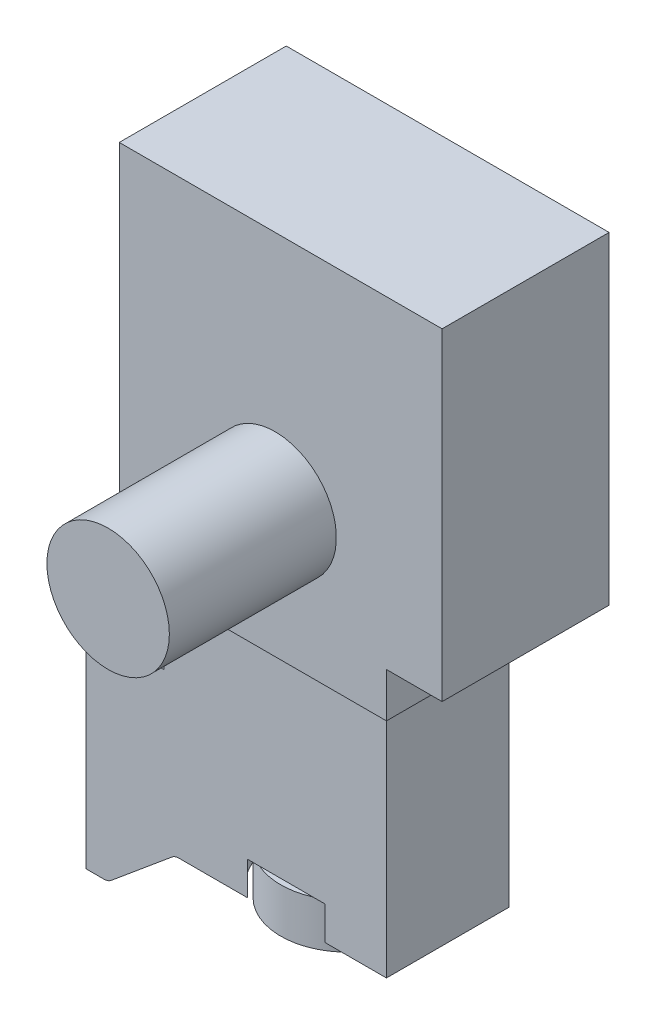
ISO-10303-21;
HEADER;
FILE_DESCRIPTION(('STEP AP214'),'2;1');
FILE_NAME('part.step','',(''),(''),'','','');
FILE_SCHEMA(('AUTOMOTIVE_DESIGN { 1 0 10303 214 1 1 1 1 }'));
ENDSEC;
DATA;
#1=APPLICATION_CONTEXT('core data for automotive mechanical design processes');
#2=APPLICATION_PROTOCOL_DEFINITION('international standard','automotive_design',2000,#1);
#3=PRODUCT_CONTEXT('',#1,'mechanical');
#4=PRODUCT('Part','Part','',(#3));
#5=PRODUCT_RELATED_PRODUCT_CATEGORY('part','',(#4));
#6=PRODUCT_DEFINITION_FORMATION('','',#4);
#7=PRODUCT_DEFINITION_CONTEXT('part definition',#1,'design');
#8=PRODUCT_DEFINITION('design','',#6,#7);
#9=PRODUCT_DEFINITION_SHAPE('','',#8);
#10=(LENGTH_UNIT() NAMED_UNIT(*) SI_UNIT(.MILLI.,.METRE.));
#11=(NAMED_UNIT(*) PLANE_ANGLE_UNIT() SI_UNIT($,.RADIAN.));
#12=(NAMED_UNIT(*) SI_UNIT($,.STERADIAN.) SOLID_ANGLE_UNIT());
#13=UNCERTAINTY_MEASURE_WITH_UNIT(LENGTH_MEASURE(1.E-05),#10,'distance_accuracy_value','');
#14=(GEOMETRIC_REPRESENTATION_CONTEXT(3) GLOBAL_UNCERTAINTY_ASSIGNED_CONTEXT((#13)) GLOBAL_UNIT_ASSIGNED_CONTEXT((#10,
#11,#12)) REPRESENTATION_CONTEXT('',''));
#15=CARTESIAN_POINT('',(0.,0.,0.));
#16=DIRECTION('',(0.,0.,1.));
#17=DIRECTION('',(1.,0.,0.));
#18=AXIS2_PLACEMENT_3D('',#15,#16,#17);
#19=CARTESIAN_POINT('',(18.,8.,0.));
#20=DIRECTION('',(0.,-1.,0.));
#21=DIRECTION('',(1.,0.,0.));
#22=AXIS2_PLACEMENT_3D('',#19,#20,#21);
#23=PLANE('',#22);
#24=DIRECTION('',(1.,0.,0.));
#25=VECTOR('',#24,1.);
#26=CARTESIAN_POINT('',(8.36204993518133,8.,-5.5));
#27=LINE('',#26,#25);
#28=CARTESIAN_POINT('',(14.5358983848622,8.,-5.5));
#29=VERTEX_POINT('',#28);
#30=CARTESIAN_POINT('',(15.6020842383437,8.,-5.5));
#31=VERTEX_POINT('',#30);
#32=EDGE_CURVE('E259',#29,#31,#27,.T.);
#33=ORIENTED_EDGE('',*,*,#32,.T.);
#34=CARTESIAN_POINT('',(18.,8.,0.));
#35=DIRECTION('',(0.,-1.,0.));
#36=DIRECTION('',(1.,0.,0.));
#37=AXIS2_PLACEMENT_3D('',#34,#35,#36);
#38=CIRCLE('',#37,6.);
#39=CARTESIAN_POINT('',(15.6020842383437,8.,5.5));
#40=VERTEX_POINT('',#39);
#41=EDGE_CURVE('E11',#31,#40,#38,.F.);
#42=ORIENTED_EDGE('',*,*,#41,.T.);
#43=DIRECTION('',(1.,0.,0.));
#44=VECTOR('',#43,1.);
#45=CARTESIAN_POINT('',(8.36204993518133,8.,5.5));
#46=LINE('',#45,#44);
#47=CARTESIAN_POINT('',(14.5358983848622,8.,5.5));
#48=VERTEX_POINT('',#47);
#49=EDGE_CURVE('E202',#48,#40,#46,.T.);
#50=ORIENTED_EDGE('',*,*,#49,.F.);
#51=CARTESIAN_POINT('',(18.,8.,0.));
#52=DIRECTION('',(0.,-1.,0.));
#53=DIRECTION('',(1.,0.,0.));
#54=AXIS2_PLACEMENT_3D('',#51,#52,#53);
#55=CIRCLE('',#54,6.50000000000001);
#56=EDGE_CURVE('E54',#48,#29,#55,.T.);
#57=ORIENTED_EDGE('',*,*,#56,.T.);
#58=EDGE_LOOP('',(#33,#42,#50,#57));
#59=FACE_BOUND('',#58,.T.);
#60=ADVANCED_FACE('F31',(#59),#23,.T.);
#61=CARTESIAN_POINT('',(20.3979157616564,8.,5.5));
#62=VERTEX_POINT('',#61);
#63=CARTESIAN_POINT('',(21.4641016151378,8.,5.5));
#64=VERTEX_POINT('',#63);
#65=EDGE_CURVE('E194',#62,#64,#46,.T.);
#66=ORIENTED_EDGE('',*,*,#65,.F.);
#67=CARTESIAN_POINT('',(20.3979157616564,8.,-5.5));
#68=VERTEX_POINT('',#67);
#69=EDGE_CURVE('E35',#62,#68,#38,.F.);
#70=ORIENTED_EDGE('',*,*,#69,.T.);
#71=CARTESIAN_POINT('',(21.4641016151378,8.,-5.5));
#72=VERTEX_POINT('',#71);
#73=EDGE_CURVE('E257',#68,#72,#27,.T.);
#74=ORIENTED_EDGE('',*,*,#73,.T.);
#75=EDGE_CURVE('E197',#72,#64,#55,.T.);
#76=ORIENTED_EDGE('',*,*,#75,.T.);
#77=EDGE_LOOP('',(#66,#70,#74,#76));
#78=FACE_BOUND('',#77,.T.);
#79=ADVANCED_FACE('F195',(#78),#23,.T.);
#80=CARTESIAN_POINT('',(8.36204993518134,5.,5.5));
#81=DIRECTION('',(0.,1.,0.));
#82=DIRECTION('',(-1.,0.,0.));
#83=AXIS2_PLACEMENT_3D('',#80,#81,#82);
#84=PLANE('',#83);
#85=DIRECTION('',(1.,0.,0.));
#86=VECTOR('',#85,1.);
#87=CARTESIAN_POINT('',(8.36204993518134,5.,5.5));
#88=LINE('',#87,#86);
#89=CARTESIAN_POINT('',(21.4641016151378,5.,5.5));
#90=VERTEX_POINT('',#89);
#91=CARTESIAN_POINT('',(27.,5.,5.5));
#92=VERTEX_POINT('',#91);
#93=EDGE_CURVE('E368',#90,#92,#88,.T.);
#94=ORIENTED_EDGE('',*,*,#93,.F.);
#95=CARTESIAN_POINT('',(18.,5.,0.));
#96=DIRECTION('',(0.,-1.,0.));
#97=DIRECTION('',(1.,0.,0.));
#98=AXIS2_PLACEMENT_3D('',#95,#96,#97);
#99=CIRCLE('',#98,6.50000000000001);
#100=CARTESIAN_POINT('',(21.4641016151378,5.,-5.5));
#101=VERTEX_POINT('',#100);
#102=EDGE_CURVE('E717',#101,#90,#99,.T.);
#103=ORIENTED_EDGE('',*,*,#102,.F.);
#104=DIRECTION('',(1.,0.,0.));
#105=VECTOR('',#104,1.);
#106=CARTESIAN_POINT('',(8.36204993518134,5.,-5.5));
#107=LINE('',#106,#105);
#108=CARTESIAN_POINT('',(27.,5.,-5.5));
#109=VERTEX_POINT('',#108);
#110=EDGE_CURVE('E284',#101,#109,#107,.T.);
#111=ORIENTED_EDGE('',*,*,#110,.T.);
#112=DIRECTION('',(0.,0.,-1.));
#113=VECTOR('',#112,1.);
#114=CARTESIAN_POINT('',(27.,5.,5.5));
#115=LINE('',#114,#113);
#116=EDGE_CURVE('E313',#92,#109,#115,.T.);
#117=ORIENTED_EDGE('',*,*,#116,.F.);
#118=EDGE_LOOP('',(#94,#103,#111,#117));
#119=FACE_BOUND('',#118,.T.);
#120=ADVANCED_FACE('F378',(#119),#84,.F.);
#121=CARTESIAN_POINT('',(5.,31.,7.5));
#122=DIRECTION('',(0.,0.,-1.));
#123=DIRECTION('',(-1.,0.,0.));
#124=AXIS2_PLACEMENT_3D('',#121,#122,#123);
#125=PLANE('',#124);
#126=DIRECTION('',(1.,0.,0.));
#127=VECTOR('',#126,1.);
#128=CARTESIAN_POINT('',(5.,27.,7.5));
#129=LINE('',#128,#127);
#130=CARTESIAN_POINT('',(5.,27.,7.5));
#131=VERTEX_POINT('',#130);
#132=CARTESIAN_POINT('',(29.,27.,7.5));
#133=VERTEX_POINT('',#132);
#134=EDGE_CURVE('E226',#131,#133,#129,.T.);
#135=ORIENTED_EDGE('',*,*,#134,.T.);
#136=DIRECTION('',(0.,-1.,0.));
#137=VECTOR('',#136,1.);
#138=CARTESIAN_POINT('',(29.,31.,7.5));
#139=LINE('',#138,#137);
#140=CARTESIAN_POINT('',(29.,31.,7.5));
#141=VERTEX_POINT('',#140);
#142=EDGE_CURVE('E247',#141,#133,#139,.T.);
#143=ORIENTED_EDGE('',*,*,#142,.F.);
#144=DIRECTION('',(1.,0.,0.));
#145=VECTOR('',#144,1.);
#146=CARTESIAN_POINT('',(5.,31.,7.5));
#147=LINE('',#146,#145);
#148=CARTESIAN_POINT('',(34.,31.,7.5));
#149=VERTEX_POINT('',#148);
#150=EDGE_CURVE('E216',#141,#149,#147,.T.);
#151=ORIENTED_EDGE('',*,*,#150,.T.);
#152=DIRECTION('',(0.,-1.,0.));
#153=VECTOR('',#152,1.);
#154=CARTESIAN_POINT('',(34.,60.,7.5));
#155=LINE('',#154,#153);
#156=CARTESIAN_POINT('',(34.,60.,7.5));
#157=VERTEX_POINT('',#156);
#158=EDGE_CURVE('E230',#157,#149,#155,.T.);
#159=ORIENTED_EDGE('',*,*,#158,.F.);
#160=DIRECTION('',(1.,0.,0.));
#161=VECTOR('',#160,1.);
#162=CARTESIAN_POINT('',(4.99999999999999,60.,7.5));
#163=LINE('',#162,#161);
#164=CARTESIAN_POINT('',(4.99999999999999,60.,7.5));
#165=VERTEX_POINT('',#164);
#166=EDGE_CURVE('E413',#165,#157,#163,.T.);
#167=ORIENTED_EDGE('',*,*,#166,.F.);
#168=DIRECTION('',(0.,-1.,0.));
#169=VECTOR('',#168,1.);
#170=CARTESIAN_POINT('',(5.,31.,7.5));
#171=LINE('',#170,#169);
#172=EDGE_CURVE('E239',#165,#131,#171,.T.);
#173=ORIENTED_EDGE('',*,*,#172,.T.);
#174=EDGE_LOOP('',(#135,#143,#151,#159,#167,#173));
#175=FACE_BOUND('',#174,.T.);
#176=CARTESIAN_POINT('',(19.,39.,7.5));
#177=DIRECTION('',(0.,0.,-1.));
#178=DIRECTION('',(-1.,0.,0.));
#179=AXIS2_PLACEMENT_3D('',#176,#177,#178);
#180=CIRCLE('',#179,5.5);
#181=CARTESIAN_POINT('',(13.5,39.,7.5));
#182=VERTEX_POINT('',#181);
#183=EDGE_CURVE('E254',#182,#182,#180,.F.);
#184=ORIENTED_EDGE('',*,*,#183,.F.);
#185=EDGE_LOOP('',(#184));
#186=FACE_BOUND('',#185,.T.);
#187=ADVANCED_FACE('F409',(#175,#186),#125,.F.);
#188=CARTESIAN_POINT('',(0.,19.,5.5));
#189=DIRECTION('',(0.,-1.,0.));
#190=DIRECTION('',(1.,0.,0.));
#191=AXIS2_PLACEMENT_3D('',#188,#189,#190);
#192=PLANE('',#191);
#193=DIRECTION('',(0.,0.,1.));
#194=VECTOR('',#193,1.);
#195=CARTESIAN_POINT('',(7.,19.,-5.5));
#196=LINE('',#195,#194);
#197=CARTESIAN_POINT('',(7.,19.,-5.5));
#198=VERTEX_POINT('',#197);
#199=CARTESIAN_POINT('',(7.,19.,5.5));
#200=VERTEX_POINT('',#199);
#201=EDGE_CURVE('E250',#198,#200,#196,.T.);
#202=ORIENTED_EDGE('',*,*,#201,.F.);
#203=DIRECTION('',(-1.,0.,0.));
#204=VECTOR('',#203,1.);
#205=CARTESIAN_POINT('',(0.,19.,-5.5));
#206=LINE('',#205,#204);
#207=CARTESIAN_POINT('',(0.,19.,-5.5));
#208=VERTEX_POINT('',#207);
#209=EDGE_CURVE('E286',#198,#208,#206,.T.);
#210=ORIENTED_EDGE('',*,*,#209,.T.);
#211=DIRECTION('',(0.,0.,-1.));
#212=VECTOR('',#211,1.);
#213=CARTESIAN_POINT('',(0.,19.,5.5));
#214=LINE('',#213,#212);
#215=CARTESIAN_POINT('',(0.,19.,5.5));
#216=VERTEX_POINT('',#215);
#217=EDGE_CURVE('E303',#216,#208,#214,.T.);
#218=ORIENTED_EDGE('',*,*,#217,.F.);
#219=DIRECTION('',(-1.,0.,0.));
#220=VECTOR('',#219,1.);
#221=CARTESIAN_POINT('',(0.,19.,5.5));
#222=LINE('',#221,#220);
#223=EDGE_CURVE('E300',#200,#216,#222,.T.);
#224=ORIENTED_EDGE('',*,*,#223,.F.);
#225=EDGE_LOOP('',(#202,#210,#218,#224));
#226=FACE_BOUND('',#225,.T.);
#227=ADVANCED_FACE('F498',(#226),#192,.F.);
#228=CARTESIAN_POINT('',(0.,0.,5.5));
#229=DIRECTION('',(1.,0.,0.));
#230=DIRECTION('',(0.,0.,-1.));
#231=AXIS2_PLACEMENT_3D('',#228,#229,#230);
#232=PLANE('',#231);
#233=DIRECTION('',(0.,-1.,0.));
#234=VECTOR('',#233,1.);
#235=CARTESIAN_POINT('',(0.,0.,-5.5));
#236=LINE('',#235,#234);
#237=CARTESIAN_POINT('',(0.,0.,-5.5));
#238=VERTEX_POINT('',#237);
#239=EDGE_CURVE('E339',#208,#238,#236,.T.);
#240=ORIENTED_EDGE('',*,*,#239,.T.);
#241=DIRECTION('',(0.,0.,-1.));
#242=VECTOR('',#241,1.);
#243=CARTESIAN_POINT('',(0.,0.,5.5));
#244=LINE('',#243,#242);
#245=CARTESIAN_POINT('',(0.,0.,5.5));
#246=VERTEX_POINT('',#245);
#247=EDGE_CURVE('E258',#246,#238,#244,.T.);
#248=ORIENTED_EDGE('',*,*,#247,.F.);
#249=DIRECTION('',(0.,-1.,0.));
#250=VECTOR('',#249,1.);
#251=CARTESIAN_POINT('',(0.,0.,5.5));
#252=LINE('',#251,#250);
#253=EDGE_CURVE('E294',#216,#246,#252,.T.);
#254=ORIENTED_EDGE('',*,*,#253,.F.);
#255=ORIENTED_EDGE('',*,*,#217,.T.);
#256=EDGE_LOOP('',(#240,#248,#254,#255));
#257=FACE_BOUND('',#256,.T.);
#258=ADVANCED_FACE('F33',(#257),#232,.F.);
#259=CARTESIAN_POINT('',(0.,0.,5.5));
#260=DIRECTION('',(0.,1.,0.));
#261=DIRECTION('',(0.,0.,1.));
#262=AXIS2_PLACEMENT_3D('',#259,#260,#261);
#263=PLANE('',#262);
#264=DIRECTION('',(1.,0.,0.));
#265=VECTOR('',#264,1.);
#266=CARTESIAN_POINT('',(0.,0.,-5.5));
#267=LINE('',#266,#265);
#268=CARTESIAN_POINT('',(1.63795006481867,0.,-5.5));
#269=VERTEX_POINT('',#268);
#270=EDGE_CURVE('E333',#238,#269,#267,.T.);
#271=ORIENTED_EDGE('',*,*,#270,.T.);
#272=DIRECTION('',(0.,0.,-1.));
#273=VECTOR('',#272,1.);
#274=CARTESIAN_POINT('',(1.63795006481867,0.,5.5));
#275=LINE('',#274,#273);
#276=CARTESIAN_POINT('',(1.63795006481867,0.,5.5));
#277=VERTEX_POINT('',#276);
#278=EDGE_CURVE('E322',#277,#269,#275,.T.);
#279=ORIENTED_EDGE('',*,*,#278,.F.);
#280=DIRECTION('',(1.,0.,0.));
#281=VECTOR('',#280,1.);
#282=CARTESIAN_POINT('',(0.,0.,5.5));
#283=LINE('',#282,#281);
#284=EDGE_CURVE('E334',#246,#277,#283,.T.);
#285=ORIENTED_EDGE('',*,*,#284,.F.);
#286=ORIENTED_EDGE('',*,*,#247,.T.);
#287=EDGE_LOOP('',(#271,#279,#285,#286));
#288=FACE_BOUND('',#287,.T.);
#289=ADVANCED_FACE('F332',(#288),#263,.F.);
#290=CARTESIAN_POINT('',(1.63795006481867,1.,5.5));
#291=DIRECTION('',(0.,0.,-1.));
#292=DIRECTION('',(-1.,0.,0.));
#293=AXIS2_PLACEMENT_3D('',#290,#291,#292);
#294=CYLINDRICAL_SURFACE('',#293,1.);
#295=CARTESIAN_POINT('',(1.63795006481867,1.,-5.5));
#296=DIRECTION('',(0.,0.,1.));
#297=DIRECTION('',(1.,0.,0.));
#298=AXIS2_PLACEMENT_3D('',#295,#296,#297);
#299=CIRCLE('',#298,1.);
#300=CARTESIAN_POINT('',(2.27813446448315,0.231778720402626,-5.5));
#301=VERTEX_POINT('',#300);
#302=EDGE_CURVE('E344',#269,#301,#299,.T.);
#303=ORIENTED_EDGE('',*,*,#302,.T.);
#304=DIRECTION('',(0.,0.,-1.));
#305=VECTOR('',#304,1.);
#306=CARTESIAN_POINT('',(2.27813446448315,0.231778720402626,5.5));
#307=LINE('',#306,#305);
#308=CARTESIAN_POINT('',(2.27813446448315,0.231778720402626,5.5));
#309=VERTEX_POINT('',#308);
#310=EDGE_CURVE('E320',#309,#301,#307,.T.);
#311=ORIENTED_EDGE('',*,*,#310,.F.);
#312=CARTESIAN_POINT('',(1.63795006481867,1.,5.5));
#313=DIRECTION('',(0.,0.,1.));
#314=DIRECTION('',(1.,0.,0.));
#315=AXIS2_PLACEMENT_3D('',#312,#313,#314);
#316=CIRCLE('',#315,1.);
#317=EDGE_CURVE('E366',#277,#309,#316,.T.);
#318=ORIENTED_EDGE('',*,*,#317,.F.);
#319=ORIENTED_EDGE('',*,*,#278,.T.);
#320=EDGE_LOOP('',(#303,#311,#318,#319));
#321=FACE_BOUND('',#320,.T.);
#322=ADVANCED_FACE('F361',(#321),#294,.T.);
#323=CARTESIAN_POINT('',(2.27813446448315,0.231778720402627,5.5));
#324=DIRECTION('',(-0.64018439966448,0.768221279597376,0.));
#325=DIRECTION('',(-0.768221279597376,-0.64018439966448,0.));
#326=AXIS2_PLACEMENT_3D('',#323,#324,#325);
#327=PLANE('',#326);
#328=DIRECTION('',(0.768221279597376,0.64018439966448,0.));
#329=VECTOR('',#328,1.);
#330=CARTESIAN_POINT('',(2.27813446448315,0.231778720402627,-5.5));
#331=LINE('',#330,#329);
#332=CARTESIAN_POINT('',(7.72186553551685,4.76822127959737,-5.5));
#333=VERTEX_POINT('',#332);
#334=EDGE_CURVE('E353',#301,#333,#331,.T.);
#335=ORIENTED_EDGE('',*,*,#334,.T.);
#336=DIRECTION('',(0.,0.,-1.));
#337=VECTOR('',#336,1.);
#338=CARTESIAN_POINT('',(7.72186553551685,4.76822127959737,5.5));
#339=LINE('',#338,#337);
#340=CARTESIAN_POINT('',(7.72186553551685,4.76822127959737,5.5));
#341=VERTEX_POINT('',#340);
#342=EDGE_CURVE('E317',#341,#333,#339,.T.);
#343=ORIENTED_EDGE('',*,*,#342,.F.);
#344=DIRECTION('',(0.768221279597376,0.64018439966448,0.));
#345=VECTOR('',#344,1.);
#346=CARTESIAN_POINT('',(2.27813446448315,0.231778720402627,5.5));
#347=LINE('',#346,#345);
#348=EDGE_CURVE('E364',#309,#341,#347,.T.);
#349=ORIENTED_EDGE('',*,*,#348,.F.);
#350=ORIENTED_EDGE('',*,*,#310,.T.);
#351=EDGE_LOOP('',(#335,#343,#349,#350));
#352=FACE_BOUND('',#351,.T.);
#353=ADVANCED_FACE('F363',(#352),#327,.F.);
#354=CARTESIAN_POINT('',(8.36204993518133,4.,5.5));
#355=DIRECTION('',(0.,0.,-1.));
#356=DIRECTION('',(-1.,0.,0.));
#357=AXIS2_PLACEMENT_3D('',#354,#355,#356);
#358=CYLINDRICAL_SURFACE('',#357,1.);
#359=CARTESIAN_POINT('',(8.36204993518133,4.,-5.5));
#360=DIRECTION('',(0.,0.,-1.));
#361=DIRECTION('',(1.,0.,0.));
#362=AXIS2_PLACEMENT_3D('',#359,#360,#361);
#363=CIRCLE('',#362,1.);
#364=CARTESIAN_POINT('',(8.36204993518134,5.,-5.5));
#365=VERTEX_POINT('',#364);
#366=EDGE_CURVE('E288',#333,#365,#363,.T.);
#367=ORIENTED_EDGE('',*,*,#366,.T.);
#368=DIRECTION('',(0.,0.,-1.));
#369=VECTOR('',#368,1.);
#370=CARTESIAN_POINT('',(8.36204993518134,5.,5.5));
#371=LINE('',#370,#369);
#372=CARTESIAN_POINT('',(8.36204993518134,5.,5.5));
#373=VERTEX_POINT('',#372);
#374=EDGE_CURVE('E282',#373,#365,#371,.T.);
#375=ORIENTED_EDGE('',*,*,#374,.F.);
#376=CARTESIAN_POINT('',(8.36204993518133,4.,5.5));
#377=DIRECTION('',(0.,0.,-1.));
#378=DIRECTION('',(1.,0.,0.));
#379=AXIS2_PLACEMENT_3D('',#376,#377,#378);
#380=CIRCLE('',#379,1.);
#381=EDGE_CURVE('E365',#341,#373,#380,.T.);
#382=ORIENTED_EDGE('',*,*,#381,.F.);
#383=ORIENTED_EDGE('',*,*,#342,.T.);
#384=EDGE_LOOP('',(#367,#375,#382,#383));
#385=FACE_BOUND('',#384,.T.);
#386=ADVANCED_FACE('F358',(#385),#358,.F.);
#387=CARTESIAN_POINT('',(14.5358983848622,5.,-5.5));
#388=VERTEX_POINT('',#387);
#389=EDGE_CURVE('E271',#365,#388,#107,.T.);
#390=ORIENTED_EDGE('',*,*,#389,.T.);
#391=CARTESIAN_POINT('',(14.5358983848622,5.,5.5));
#392=VERTEX_POINT('',#391);
#393=EDGE_CURVE('E279',#392,#388,#99,.T.);
#394=ORIENTED_EDGE('',*,*,#393,.F.);
#395=EDGE_CURVE('E371',#373,#392,#88,.T.);
#396=ORIENTED_EDGE('',*,*,#395,.F.);
#397=ORIENTED_EDGE('',*,*,#374,.T.);
#398=EDGE_LOOP('',(#390,#394,#396,#397));
#399=FACE_BOUND('',#398,.T.);
#400=ADVANCED_FACE('F277',(#399),#84,.F.);
#401=CARTESIAN_POINT('',(27.,5.,5.5));
#402=DIRECTION('',(-1.,0.,0.));
#403=DIRECTION('',(0.,-1.,0.));
#404=AXIS2_PLACEMENT_3D('',#401,#402,#403);
#405=PLANE('',#404);
#406=DIRECTION('',(0.,1.,0.));
#407=VECTOR('',#406,1.);
#408=CARTESIAN_POINT('',(27.,5.,-5.5));
#409=LINE('',#408,#407);
#410=CARTESIAN_POINT('',(27.,27.,-5.5));
#411=VERTEX_POINT('',#410);
#412=EDGE_CURVE('E283',#109,#411,#409,.T.);
#413=ORIENTED_EDGE('',*,*,#412,.T.);
#414=DIRECTION('',(0.,0.,-1.));
#415=VECTOR('',#414,1.);
#416=CARTESIAN_POINT('',(27.,27.,5.5));
#417=LINE('',#416,#415);
#418=CARTESIAN_POINT('',(27.,27.,5.5));
#419=VERTEX_POINT('',#418);
#420=EDGE_CURVE('E384',#419,#411,#417,.T.);
#421=ORIENTED_EDGE('',*,*,#420,.F.);
#422=DIRECTION('',(0.,1.,0.));
#423=VECTOR('',#422,1.);
#424=CARTESIAN_POINT('',(27.,5.,5.5));
#425=LINE('',#424,#423);
#426=EDGE_CURVE('E304',#92,#419,#425,.T.);
#427=ORIENTED_EDGE('',*,*,#426,.F.);
#428=ORIENTED_EDGE('',*,*,#116,.T.);
#429=EDGE_LOOP('',(#413,#421,#427,#428));
#430=FACE_BOUND('',#429,.T.);
#431=ADVANCED_FACE('F382',(#430),#405,.F.);
#432=CARTESIAN_POINT('',(8.36204993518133,4.,5.5));
#433=DIRECTION('',(0.,0.,1.));
#434=DIRECTION('',(1.,0.,0.));
#435=AXIS2_PLACEMENT_3D('',#432,#433,#434);
#436=PLANE('',#435);
#437=DIRECTION('',(0.,-1.,0.));
#438=VECTOR('',#437,1.);
#439=CARTESIAN_POINT('',(14.5358983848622,8.,5.5));
#440=LINE('',#439,#438);
#441=EDGE_CURVE('E211',#48,#392,#440,.T.);
#442=ORIENTED_EDGE('',*,*,#441,.F.);
#443=ORIENTED_EDGE('',*,*,#49,.T.);
#444=EDGE_CURVE('E190',#40,#62,#46,.T.);
#445=ORIENTED_EDGE('',*,*,#444,.T.);
#446=ORIENTED_EDGE('',*,*,#65,.T.);
#447=DIRECTION('',(0.,-1.,0.));
#448=VECTOR('',#447,1.);
#449=CARTESIAN_POINT('',(21.4641016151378,8.,5.5));
#450=LINE('',#449,#448);
#451=EDGE_CURVE('E206',#90,#64,#450,.F.);
#452=ORIENTED_EDGE('',*,*,#451,.F.);
#453=ORIENTED_EDGE('',*,*,#93,.T.);
#454=ORIENTED_EDGE('',*,*,#426,.T.);
#455=DIRECTION('',(1.,0.,0.));
#456=VECTOR('',#455,1.);
#457=CARTESIAN_POINT('',(7.,27.,5.5));
#458=LINE('',#457,#456);
#459=CARTESIAN_POINT('',(7.,27.,5.5));
#460=VERTEX_POINT('',#459);
#461=EDGE_CURVE('E350',#460,#419,#458,.T.);
#462=ORIENTED_EDGE('',*,*,#461,.F.);
#463=DIRECTION('',(0.,-1.,0.));
#464=VECTOR('',#463,1.);
#465=CARTESIAN_POINT('',(7.,27.,5.5));
#466=LINE('',#465,#464);
#467=EDGE_CURVE('E347',#460,#200,#466,.T.);
#468=ORIENTED_EDGE('',*,*,#467,.T.);
#469=ORIENTED_EDGE('',*,*,#223,.T.);
#470=ORIENTED_EDGE('',*,*,#253,.T.);
#471=ORIENTED_EDGE('',*,*,#284,.T.);
#472=ORIENTED_EDGE('',*,*,#317,.T.);
#473=ORIENTED_EDGE('',*,*,#348,.T.);
#474=ORIENTED_EDGE('',*,*,#381,.T.);
#475=ORIENTED_EDGE('',*,*,#395,.T.);
#476=EDGE_LOOP('',(#442,#443,#445,#446,#452,#453,#454,#462,#468,#469,#470,#471,#472,#473,#474,#475));
#477=FACE_BOUND('',#476,.T.);
#478=ADVANCED_FACE('F205',(#477),#436,.T.);
#479=CARTESIAN_POINT('',(8.36204993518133,4.,-5.5));
#480=DIRECTION('',(0.,0.,1.));
#481=DIRECTION('',(1.,0.,0.));
#482=AXIS2_PLACEMENT_3D('',#479,#480,#481);
#483=PLANE('',#482);
#484=ORIENTED_EDGE('',*,*,#32,.F.);
#485=DIRECTION('',(0.,-1.,0.));
#486=VECTOR('',#485,1.);
#487=CARTESIAN_POINT('',(14.5358983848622,8.,-5.5));
#488=LINE('',#487,#486);
#489=EDGE_CURVE('E186',#29,#388,#488,.T.);
#490=ORIENTED_EDGE('',*,*,#489,.T.);
#491=ORIENTED_EDGE('',*,*,#389,.F.);
#492=ORIENTED_EDGE('',*,*,#366,.F.);
#493=ORIENTED_EDGE('',*,*,#334,.F.);
#494=ORIENTED_EDGE('',*,*,#302,.F.);
#495=ORIENTED_EDGE('',*,*,#270,.F.);
#496=ORIENTED_EDGE('',*,*,#239,.F.);
#497=ORIENTED_EDGE('',*,*,#209,.F.);
#498=DIRECTION('',(0.,-1.,0.));
#499=VECTOR('',#498,1.);
#500=CARTESIAN_POINT('',(7.,27.,-5.5));
#501=LINE('',#500,#499);
#502=CARTESIAN_POINT('',(7.,27.,-5.5));
#503=VERTEX_POINT('',#502);
#504=EDGE_CURVE('E342',#503,#198,#501,.T.);
#505=ORIENTED_EDGE('',*,*,#504,.F.);
#506=DIRECTION('',(-1.,0.,0.));
#507=VECTOR('',#506,1.);
#508=CARTESIAN_POINT('',(27.,27.,-5.5));
#509=LINE('',#508,#507);
#510=EDGE_CURVE('E389',#411,#503,#509,.T.);
#511=ORIENTED_EDGE('',*,*,#510,.F.);
#512=ORIENTED_EDGE('',*,*,#412,.F.);
#513=ORIENTED_EDGE('',*,*,#110,.F.);
#514=DIRECTION('',(0.,-1.,0.));
#515=VECTOR('',#514,1.);
#516=CARTESIAN_POINT('',(21.4641016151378,8.,-5.5));
#517=LINE('',#516,#515);
#518=EDGE_CURVE('E261',#101,#72,#517,.F.);
#519=ORIENTED_EDGE('',*,*,#518,.T.);
#520=ORIENTED_EDGE('',*,*,#73,.F.);
#521=EDGE_CURVE('E262',#31,#68,#27,.T.);
#522=ORIENTED_EDGE('',*,*,#521,.F.);
#523=EDGE_LOOP('',(#484,#490,#491,#492,#493,#494,#495,#496,#497,#505,#511,#512,#513,#519,#520,#522));
#524=FACE_BOUND('',#523,.T.);
#525=ADVANCED_FACE('F269',(#524),#483,.F.);
#526=CARTESIAN_POINT('',(7.,27.,-5.5));
#527=DIRECTION('',(1.,0.,0.));
#528=DIRECTION('',(0.,1.,0.));
#529=AXIS2_PLACEMENT_3D('',#526,#527,#528);
#530=PLANE('',#529);
#531=ORIENTED_EDGE('',*,*,#201,.T.);
#532=ORIENTED_EDGE('',*,*,#467,.F.);
#533=DIRECTION('',(0.,0.,1.));
#534=VECTOR('',#533,1.);
#535=CARTESIAN_POINT('',(7.,27.,-5.5));
#536=LINE('',#535,#534);
#537=EDGE_CURVE('E394',#503,#460,#536,.T.);
#538=ORIENTED_EDGE('',*,*,#537,.F.);
#539=ORIENTED_EDGE('',*,*,#504,.T.);
#540=EDGE_LOOP('',(#531,#532,#538,#539));
#541=FACE_BOUND('',#540,.T.);
#542=ADVANCED_FACE('F481',(#541),#530,.F.);
#543=CARTESIAN_POINT('',(29.,27.,7.5));
#544=DIRECTION('',(0.,1.,0.));
#545=DIRECTION('',(-1.,0.,0.));
#546=AXIS2_PLACEMENT_3D('',#543,#544,#545);
#547=PLANE('',#546);
#548=ORIENTED_EDGE('',*,*,#134,.F.);
#549=DIRECTION('',(0.,0.,1.));
#550=VECTOR('',#549,1.);
#551=CARTESIAN_POINT('',(5.,27.,-7.5));
#552=LINE('',#551,#550);
#553=CARTESIAN_POINT('',(5.,27.,-7.5));
#554=VERTEX_POINT('',#553);
#555=EDGE_CURVE('E234',#554,#131,#552,.T.);
#556=ORIENTED_EDGE('',*,*,#555,.F.);
#557=DIRECTION('',(-1.,0.,0.));
#558=VECTOR('',#557,1.);
#559=CARTESIAN_POINT('',(29.,27.,-7.5));
#560=LINE('',#559,#558);
#561=CARTESIAN_POINT('',(29.,27.,-7.5));
#562=VERTEX_POINT('',#561);
#563=EDGE_CURVE('E232',#562,#554,#560,.T.);
#564=ORIENTED_EDGE('',*,*,#563,.F.);
#565=DIRECTION('',(0.,0.,-1.));
#566=VECTOR('',#565,1.);
#567=CARTESIAN_POINT('',(29.,27.,7.5));
#568=LINE('',#567,#566);
#569=EDGE_CURVE('E229',#133,#562,#568,.T.);
#570=ORIENTED_EDGE('',*,*,#569,.F.);
#571=EDGE_LOOP('',(#548,#556,#564,#570));
#572=FACE_BOUND('',#571,.T.);
#573=ORIENTED_EDGE('',*,*,#461,.T.);
#574=ORIENTED_EDGE('',*,*,#420,.T.);
#575=ORIENTED_EDGE('',*,*,#510,.T.);
#576=ORIENTED_EDGE('',*,*,#537,.T.);
#577=EDGE_LOOP('',(#573,#574,#575,#576));
#578=FACE_BOUND('',#577,.T.);
#579=ADVANCED_FACE('F392',(#572,#578),#547,.F.);
#580=CARTESIAN_POINT('',(29.,31.,7.5));
#581=DIRECTION('',(-1.,0.,0.));
#582=DIRECTION('',(0.,-1.,0.));
#583=AXIS2_PLACEMENT_3D('',#580,#581,#582);
#584=PLANE('',#583);
#585=ORIENTED_EDGE('',*,*,#569,.T.);
#586=DIRECTION('',(0.,-1.,0.));
#587=VECTOR('',#586,1.);
#588=CARTESIAN_POINT('',(29.,31.,-7.5));
#589=LINE('',#588,#587);
#590=CARTESIAN_POINT('',(29.,31.,-7.5));
#591=VERTEX_POINT('',#590);
#592=EDGE_CURVE('E251',#591,#562,#589,.T.);
#593=ORIENTED_EDGE('',*,*,#592,.F.);
#594=DIRECTION('',(0.,0.,-1.));
#595=VECTOR('',#594,1.);
#596=CARTESIAN_POINT('',(29.,31.,7.5));
#597=LINE('',#596,#595);
#598=EDGE_CURVE('E236',#141,#591,#597,.T.);
#599=ORIENTED_EDGE('',*,*,#598,.F.);
#600=ORIENTED_EDGE('',*,*,#142,.T.);
#601=EDGE_LOOP('',(#585,#593,#599,#600));
#602=FACE_BOUND('',#601,.T.);
#603=ADVANCED_FACE('F418',(#602),#584,.F.);
#604=CARTESIAN_POINT('',(29.,31.,-7.5));
#605=DIRECTION('',(0.,0.,1.));
#606=DIRECTION('',(1.,0.,0.));
#607=AXIS2_PLACEMENT_3D('',#604,#605,#606);
#608=PLANE('',#607);
#609=ORIENTED_EDGE('',*,*,#563,.T.);
#610=DIRECTION('',(0.,-1.,0.));
#611=VECTOR('',#610,1.);
#612=CARTESIAN_POINT('',(5.,31.,-7.5));
#613=LINE('',#612,#611);
#614=CARTESIAN_POINT('',(4.99999999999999,60.,-7.5));
#615=VERTEX_POINT('',#614);
#616=EDGE_CURVE('E399',#615,#554,#613,.T.);
#617=ORIENTED_EDGE('',*,*,#616,.F.);
#618=DIRECTION('',(-1.,0.,0.));
#619=VECTOR('',#618,1.);
#620=CARTESIAN_POINT('',(34.,60.,-7.5));
#621=LINE('',#620,#619);
#622=CARTESIAN_POINT('',(34.,60.,-7.5));
#623=VERTEX_POINT('',#622);
#624=EDGE_CURVE('E439',#623,#615,#621,.T.);
#625=ORIENTED_EDGE('',*,*,#624,.F.);
#626=DIRECTION('',(0.,-1.,0.));
#627=VECTOR('',#626,1.);
#628=CARTESIAN_POINT('',(34.,60.,-7.5));
#629=LINE('',#628,#627);
#630=CARTESIAN_POINT('',(34.,31.,-7.5));
#631=VERTEX_POINT('',#630);
#632=EDGE_CURVE('E441',#623,#631,#629,.T.);
#633=ORIENTED_EDGE('',*,*,#632,.T.);
#634=DIRECTION('',(-1.,0.,0.));
#635=VECTOR('',#634,1.);
#636=CARTESIAN_POINT('',(34.,31.,-7.5));
#637=LINE('',#636,#635);
#638=EDGE_CURVE('E224',#631,#591,#637,.T.);
#639=ORIENTED_EDGE('',*,*,#638,.T.);
#640=ORIENTED_EDGE('',*,*,#592,.T.);
#641=EDGE_LOOP('',(#609,#617,#625,#633,#639,#640));
#642=FACE_BOUND('',#641,.T.);
#643=ADVANCED_FACE('F448',(#642),#608,.F.);
#644=CARTESIAN_POINT('',(5.,31.,-7.5));
#645=DIRECTION('',(1.,0.,0.));
#646=DIRECTION('',(0.,1.,0.));
#647=AXIS2_PLACEMENT_3D('',#644,#645,#646);
#648=PLANE('',#647);
#649=ORIENTED_EDGE('',*,*,#555,.T.);
#650=ORIENTED_EDGE('',*,*,#172,.F.);
#651=DIRECTION('',(0.,0.,1.));
#652=VECTOR('',#651,1.);
#653=CARTESIAN_POINT('',(4.99999999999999,60.,-7.5));
#654=LINE('',#653,#652);
#655=EDGE_CURVE('E429',#615,#165,#654,.T.);
#656=ORIENTED_EDGE('',*,*,#655,.F.);
#657=ORIENTED_EDGE('',*,*,#616,.T.);
#658=EDGE_LOOP('',(#649,#650,#656,#657));
#659=FACE_BOUND('',#658,.T.);
#660=ADVANCED_FACE('F446',(#659),#648,.F.);
#661=CARTESIAN_POINT('',(34.,60.,7.5));
#662=DIRECTION('',(-1.,0.,0.));
#663=DIRECTION('',(0.,-1.,0.));
#664=AXIS2_PLACEMENT_3D('',#661,#662,#663);
#665=PLANE('',#664);
#666=DIRECTION('',(0.,0.,-1.));
#667=VECTOR('',#666,1.);
#668=CARTESIAN_POINT('',(34.,31.,7.5));
#669=LINE('',#668,#667);
#670=EDGE_CURVE('E219',#149,#631,#669,.T.);
#671=ORIENTED_EDGE('',*,*,#670,.T.);
#672=ORIENTED_EDGE('',*,*,#632,.F.);
#673=DIRECTION('',(0.,0.,-1.));
#674=VECTOR('',#673,1.);
#675=CARTESIAN_POINT('',(34.,60.,7.5));
#676=LINE('',#675,#674);
#677=EDGE_CURVE('E434',#157,#623,#676,.T.);
#678=ORIENTED_EDGE('',*,*,#677,.F.);
#679=ORIENTED_EDGE('',*,*,#158,.T.);
#680=EDGE_LOOP('',(#671,#672,#678,#679));
#681=FACE_BOUND('',#680,.T.);
#682=ADVANCED_FACE('F443',(#681),#665,.F.);
#683=CARTESIAN_POINT('',(4.99999999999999,60.,-7.5));
#684=DIRECTION('',(0.,-1.,0.));
#685=DIRECTION('',(1.,0.,0.));
#686=AXIS2_PLACEMENT_3D('',#683,#684,#685);
#687=PLANE('',#686);
#688=ORIENTED_EDGE('',*,*,#655,.T.);
#689=ORIENTED_EDGE('',*,*,#166,.T.);
#690=ORIENTED_EDGE('',*,*,#677,.T.);
#691=ORIENTED_EDGE('',*,*,#624,.T.);
#692=EDGE_LOOP('',(#688,#689,#690,#691));
#693=FACE_BOUND('',#692,.T.);
#694=ADVANCED_FACE('F445',(#693),#687,.F.);
#695=CARTESIAN_POINT('',(5.,31.,-7.5));
#696=DIRECTION('',(0.,-1.,0.));
#697=DIRECTION('',(1.,0.,0.));
#698=AXIS2_PLACEMENT_3D('',#695,#696,#697);
#699=PLANE('',#698);
#700=ORIENTED_EDGE('',*,*,#150,.F.);
#701=ORIENTED_EDGE('',*,*,#598,.T.);
#702=ORIENTED_EDGE('',*,*,#638,.F.);
#703=ORIENTED_EDGE('',*,*,#670,.F.);
#704=EDGE_LOOP('',(#700,#701,#702,#703));
#705=FACE_BOUND('',#704,.T.);
#706=ADVANCED_FACE('F423',(#705),#699,.T.);
#707=CARTESIAN_POINT('',(19.,39.,22.5));
#708=DIRECTION('',(0.,0.,-1.));
#709=DIRECTION('',(-1.,0.,0.));
#710=AXIS2_PLACEMENT_3D('',#707,#708,#709);
#711=CYLINDRICAL_SURFACE('',#710,5.5);
#712=CARTESIAN_POINT('',(19.,39.,22.5));
#713=DIRECTION('',(0.,0.,1.));
#714=DIRECTION('',(1.,0.,0.));
#715=AXIS2_PLACEMENT_3D('',#712,#713,#714);
#716=CIRCLE('',#715,5.5);
#717=CARTESIAN_POINT('',(24.5,39.,22.5));
#718=VERTEX_POINT('',#717);
#719=EDGE_CURVE('E213',#718,#718,#716,.T.);
#720=ORIENTED_EDGE('',*,*,#719,.F.);
#721=EDGE_LOOP('',(#720));
#722=FACE_BOUND('',#721,.T.);
#723=ORIENTED_EDGE('',*,*,#183,.T.);
#724=EDGE_LOOP('',(#723));
#725=FACE_BOUND('',#724,.T.);
#726=ADVANCED_FACE('F472',(#722,#725),#711,.T.);
#727=CARTESIAN_POINT('',(19.,39.,22.5));
#728=DIRECTION('',(0.,0.,1.));
#729=DIRECTION('',(1.,0.,0.));
#730=AXIS2_PLACEMENT_3D('',#727,#728,#729);
#731=PLANE('',#730);
#732=ORIENTED_EDGE('',*,*,#719,.T.);
#733=EDGE_LOOP('',(#732));
#734=FACE_BOUND('',#733,.T.);
#735=ADVANCED_FACE('F469',(#734),#731,.T.);
#736=CARTESIAN_POINT('',(18.,8.,0.));
#737=DIRECTION('',(0.,-1.,0.));
#738=DIRECTION('',(1.,0.,0.));
#739=AXIS2_PLACEMENT_3D('',#736,#737,#738);
#740=CYLINDRICAL_SURFACE('',#739,6.50000000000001);
#741=ORIENTED_EDGE('',*,*,#441,.T.);
#742=ORIENTED_EDGE('',*,*,#393,.T.);
#743=ORIENTED_EDGE('',*,*,#489,.F.);
#744=ORIENTED_EDGE('',*,*,#56,.F.);
#745=EDGE_LOOP('',(#741,#742,#743,#744));
#746=FACE_BOUND('',#745,.T.);
#747=ADVANCED_FACE('F465',(#746),#740,.F.);
#748=ORIENTED_EDGE('',*,*,#451,.T.);
#749=ORIENTED_EDGE('',*,*,#75,.F.);
#750=ORIENTED_EDGE('',*,*,#518,.F.);
#751=ORIENTED_EDGE('',*,*,#102,.T.);
#752=EDGE_LOOP('',(#748,#749,#750,#751));
#753=FACE_BOUND('',#752,.T.);
#754=ADVANCED_FACE('F468',(#753),#740,.F.);
#755=CARTESIAN_POINT('',(18.,8.,0.));
#756=DIRECTION('',(0.,-1.,0.));
#757=DIRECTION('',(1.,0.,0.));
#758=AXIS2_PLACEMENT_3D('',#755,#756,#757);
#759=PLANE('',#758);
#760=CARTESIAN_POINT('',(18.,8.,0.));
#761=DIRECTION('',(0.,-1.,0.));
#762=DIRECTION('',(1.,0.,0.));
#763=AXIS2_PLACEMENT_3D('',#760,#761,#762);
#764=CIRCLE('',#763,6.);
#765=EDGE_CURVE('E46',#31,#68,#764,.T.);
#766=ORIENTED_EDGE('',*,*,#765,.F.);
#767=ORIENTED_EDGE('',*,*,#521,.T.);
#768=EDGE_LOOP('',(#766,#767));
#769=FACE_BOUND('',#768,.T.);
#770=ADVANCED_FACE('F545',(#769),#759,.F.);
#771=CARTESIAN_POINT('',(18.,4.,0.));
#772=DIRECTION('',(0.,1.,0.));
#773=DIRECTION('',(-1.,0.,0.));
#774=AXIS2_PLACEMENT_3D('',#771,#772,#773);
#775=CYLINDRICAL_SURFACE('',#774,6.);
#776=CARTESIAN_POINT('',(18.,4.,0.));
#777=DIRECTION('',(0.,-1.,0.));
#778=DIRECTION('',(1.,0.,0.));
#779=AXIS2_PLACEMENT_3D('',#776,#777,#778);
#780=CIRCLE('',#779,6.);
#781=CARTESIAN_POINT('',(24.,4.,0.));
#782=VERTEX_POINT('',#781);
#783=EDGE_CURVE('E191',#782,#782,#780,.T.);
#784=ORIENTED_EDGE('',*,*,#783,.F.);
#785=EDGE_LOOP('',(#784));
#786=FACE_BOUND('',#785,.T.);
#787=EDGE_CURVE('E182',#62,#40,#764,.T.);
#788=ORIENTED_EDGE('',*,*,#787,.T.);
#789=ORIENTED_EDGE('',*,*,#41,.F.);
#790=ORIENTED_EDGE('',*,*,#765,.T.);
#791=ORIENTED_EDGE('',*,*,#69,.F.);
#792=EDGE_LOOP('',(#788,#789,#790,#791));
#793=FACE_BOUND('',#792,.T.);
#794=ADVANCED_FACE('F181',(#786,#793),#775,.T.);
#795=CARTESIAN_POINT('',(18.,4.,0.));
#796=DIRECTION('',(0.,-1.,0.));
#797=DIRECTION('',(1.,0.,0.));
#798=AXIS2_PLACEMENT_3D('',#795,#796,#797);
#799=PLANE('',#798);
#800=ORIENTED_EDGE('',*,*,#783,.T.);
#801=EDGE_LOOP('',(#800));
#802=FACE_BOUND('',#801,.T.);
#803=ADVANCED_FACE('F560',(#802),#799,.T.);
#804=ORIENTED_EDGE('',*,*,#444,.F.);
#805=ORIENTED_EDGE('',*,*,#787,.F.);
#806=EDGE_LOOP('',(#804,#805));
#807=FACE_BOUND('',#806,.T.);
#808=ADVANCED_FACE('F188',(#807),#759,.F.);
#809=CLOSED_SHELL('',(#60,#79,#120,#187,#227,#258,#289,#322,#353,#386,#400,#431,#478,#525,#542,
#579,#603,#643,#660,#682,#694,#706,#726,#735,#747,#754,#770,#794,#803,#808));
#810=MANIFOLD_SOLID_BREP('B2',#809);
#811=ADVANCED_BREP_SHAPE_REPRESENTATION('',(#18,#810),#14);
#812=SHAPE_DEFINITION_REPRESENTATION(#9,#811);
ENDSEC;
END-ISO-10303-21;
